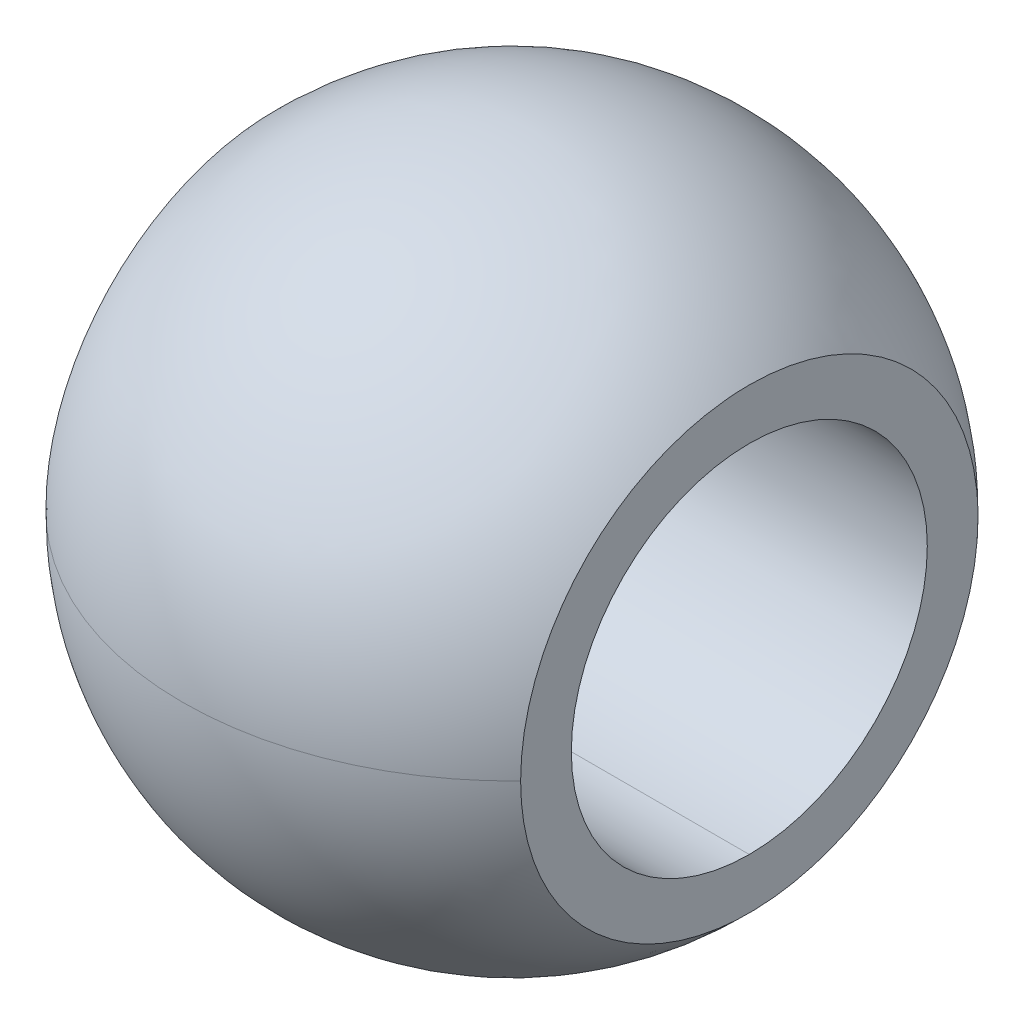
ISO-10303-21;
HEADER;
FILE_DESCRIPTION(('STEP AP214'),'2;1');
FILE_NAME('part.step','',(''),(''),'','','');
FILE_SCHEMA(('AUTOMOTIVE_DESIGN { 1 0 10303 214 1 1 1 1 }'));
ENDSEC;
DATA;
#1=APPLICATION_CONTEXT('core data for automotive mechanical design processes');
#2=APPLICATION_PROTOCOL_DEFINITION('international standard','automotive_design',2000,#1);
#3=PRODUCT_CONTEXT('',#1,'mechanical');
#4=PRODUCT('Part','Part','',(#3));
#5=PRODUCT_RELATED_PRODUCT_CATEGORY('part','',(#4));
#6=PRODUCT_DEFINITION_FORMATION('','',#4);
#7=PRODUCT_DEFINITION_CONTEXT('part definition',#1,'design');
#8=PRODUCT_DEFINITION('design','',#6,#7);
#9=PRODUCT_DEFINITION_SHAPE('','',#8);
#10=(LENGTH_UNIT() NAMED_UNIT(*) SI_UNIT(.MILLI.,.METRE.));
#11=(NAMED_UNIT(*) PLANE_ANGLE_UNIT() SI_UNIT($,.RADIAN.));
#12=(NAMED_UNIT(*) SI_UNIT($,.STERADIAN.) SOLID_ANGLE_UNIT());
#13=UNCERTAINTY_MEASURE_WITH_UNIT(LENGTH_MEASURE(1.E-05),#10,'distance_accuracy_value','');
#14=(GEOMETRIC_REPRESENTATION_CONTEXT(3) GLOBAL_UNCERTAINTY_ASSIGNED_CONTEXT((#13)) GLOBAL_UNIT_ASSIGNED_CONTEXT((#10,
#11,#12)) REPRESENTATION_CONTEXT('',''));
#15=CARTESIAN_POINT('',(0.,0.,0.));
#16=DIRECTION('',(0.,0.,1.));
#17=DIRECTION('',(1.,0.,0.));
#18=AXIS2_PLACEMENT_3D('',#15,#16,#17);
#19=CARTESIAN_POINT('',(0.,0.,0.));
#20=DIRECTION('',(-1.,0.,0.));
#21=DIRECTION('',(0.,0.,1.));
#22=AXIS2_PLACEMENT_3D('',#19,#20,#21);
#23=CYLINDRICAL_SURFACE('',#22,6.);
#24=CARTESIAN_POINT('',(-8.,0.,0.));
#25=DIRECTION('',(-1.,0.,0.));
#26=DIRECTION('',(0.,0.,1.));
#27=AXIS2_PLACEMENT_3D('',#24,#25,#26);
#28=CIRCLE('',#27,6.);
#29=CARTESIAN_POINT('',(-8.,6.,0.));
#30=VERTEX_POINT('',#29);
#31=CARTESIAN_POINT('',(-8.,-6.,0.));
#32=VERTEX_POINT('',#31);
#33=EDGE_CURVE('E68',#30,#32,#28,.T.);
#34=ORIENTED_EDGE('',*,*,#33,.T.);
#35=DIRECTION('',(-1.,0.,0.));
#36=VECTOR('',#35,1.);
#37=CARTESIAN_POINT('',(0.,-6.,0.));
#38=LINE('',#37,#36);
#39=CARTESIAN_POINT('',(8.,-6.,0.));
#40=VERTEX_POINT('',#39);
#41=EDGE_CURVE('E63',#32,#40,#38,.F.);
#42=ORIENTED_EDGE('',*,*,#41,.T.);
#43=CARTESIAN_POINT('',(8.,0.,0.));
#44=DIRECTION('',(-1.,0.,0.));
#45=DIRECTION('',(0.,0.,1.));
#46=AXIS2_PLACEMENT_3D('',#43,#44,#45);
#47=CIRCLE('',#46,6.);
#48=CARTESIAN_POINT('',(8.,6.,0.));
#49=VERTEX_POINT('',#48);
#50=EDGE_CURVE('E65',#40,#49,#47,.F.);
#51=ORIENTED_EDGE('',*,*,#50,.T.);
#52=DIRECTION('',(-1.,0.,0.));
#53=VECTOR('',#52,1.);
#54=CARTESIAN_POINT('',(0.,6.,0.));
#55=LINE('',#54,#53);
#56=EDGE_CURVE('E58',#49,#30,#55,.T.);
#57=ORIENTED_EDGE('',*,*,#56,.T.);
#58=EDGE_LOOP('',(#34,#42,#51,#57));
#59=FACE_BOUND('',#58,.T.);
#60=ADVANCED_FACE('F14',(#59),#23,.F.);
#61=CARTESIAN_POINT('',(0.,0.,0.));
#62=DIRECTION('',(-1.,0.,0.));
#63=DIRECTION('',(0.,0.,1.));
#64=AXIS2_PLACEMENT_3D('',#61,#62,#63);
#65=CYLINDRICAL_SURFACE('',#64,6.);
#66=CARTESIAN_POINT('',(8.,0.,0.));
#67=DIRECTION('',(-1.,0.,0.));
#68=DIRECTION('',(0.,0.,1.));
#69=AXIS2_PLACEMENT_3D('',#66,#67,#68);
#70=CIRCLE('',#69,6.);
#71=EDGE_CURVE('E17',#49,#40,#70,.F.);
#72=ORIENTED_EDGE('',*,*,#71,.T.);
#73=ORIENTED_EDGE('',*,*,#41,.F.);
#74=CARTESIAN_POINT('',(-8.,0.,0.));
#75=DIRECTION('',(-1.,0.,0.));
#76=DIRECTION('',(0.,0.,1.));
#77=AXIS2_PLACEMENT_3D('',#74,#75,#76);
#78=CIRCLE('',#77,6.);
#79=EDGE_CURVE('E154',#32,#30,#78,.T.);
#80=ORIENTED_EDGE('',*,*,#79,.T.);
#81=ORIENTED_EDGE('',*,*,#56,.F.);
#82=EDGE_LOOP('',(#72,#73,#80,#81));
#83=FACE_BOUND('',#82,.T.);
#84=ADVANCED_FACE('F71',(#83),#65,.F.);
#85=CARTESIAN_POINT('',(8.,22.22,-22.22));
#86=DIRECTION('',(-1.,0.,0.));
#87=DIRECTION('',(0.,0.,1.));
#88=AXIS2_PLACEMENT_3D('',#85,#86,#87);
#89=PLANE('',#88);
#90=CARTESIAN_POINT('',(8.,0.,7.70922175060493));
#91=CARTESIAN_POINT('',(8.,0.216830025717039,7.70924506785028));
#92=CARTESIAN_POINT('',(8.,0.433656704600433,7.70007486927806));
#93=CARTESIAN_POINT('',(8.,0.865758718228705,7.66351584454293));
#94=CARTESIAN_POINT('',(8.,1.08103412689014,7.63612789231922));
#95=CARTESIAN_POINT('',(8.,1.50834854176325,7.56332924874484));
#96=CARTESIAN_POINT('',(8.,1.72038987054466,7.51793219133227));
#97=CARTESIAN_POINT('',(8.,2.13989419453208,7.40944557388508));
#98=CARTESIAN_POINT('',(8.,2.34735724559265,7.34635622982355));
#99=CARTESIAN_POINT('',(8.,2.75629575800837,7.20290925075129));
#100=CARTESIAN_POINT('',(8.,2.95776938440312,7.12254638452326));
#101=CARTESIAN_POINT('',(8.,3.35330421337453,6.94510267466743));
#102=CARTESIAN_POINT('',(8.,3.5473626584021,6.84801568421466));
#103=CARTESIAN_POINT('',(8.,3.92653785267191,6.63787365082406));
#104=CARTESIAN_POINT('',(8.,4.11165789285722,6.52482454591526));
#105=CARTESIAN_POINT('',(8.,4.47172131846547,6.28353215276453));
#106=CARTESIAN_POINT('',(8.,4.64666448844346,6.15528854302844));
#107=CARTESIAN_POINT('',(8.,4.98512286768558,5.88452342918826));
#108=CARTESIAN_POINT('',(8.,5.1486383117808,5.74200221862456));
#109=CARTESIAN_POINT('',(8.,5.46308298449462,5.44369271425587));
#110=CARTESIAN_POINT('',(8.,5.61401220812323,5.28790441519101));
#111=CARTESIAN_POINT('',(8.,5.90224129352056,4.96413466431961));
#112=CARTESIAN_POINT('',(8.,6.03953834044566,4.79615070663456));
#113=CARTESIAN_POINT('',(8.,6.29948869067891,4.44921634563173));
#114=CARTESIAN_POINT('',(8.,6.42214229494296,4.270266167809));
#115=CARTESIAN_POINT('',(8.,6.65198160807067,3.90259649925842));
#116=CARTESIAN_POINT('',(8.,6.759161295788,3.71387324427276));
#117=CARTESIAN_POINT('',(8.,6.95719710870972,3.32813727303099));
#118=CARTESIAN_POINT('',(8.,7.04805915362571,3.13112759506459));
#119=CARTESIAN_POINT('',(8.,7.21283874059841,2.73020256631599));
#120=CARTESIAN_POINT('',(8.,7.28676111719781,2.5262892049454));
#121=CARTESIAN_POINT('',(8.,7.4171504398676,2.11304101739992));
#122=CARTESIAN_POINT('',(8.,7.47362158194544,1.9037075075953));
#123=CARTESIAN_POINT('',(8.,7.58364047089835,1.41469892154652));
#124=CARTESIAN_POINT('',(8.,7.63073189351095,1.13352921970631));
#125=CARTESIAN_POINT('',(8.,7.67782031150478,0.709516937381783));
#126=CARTESIAN_POINT('',(8.,7.68959165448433,0.567875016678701));
#127=CARTESIAN_POINT('',(8.,7.70529140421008,0.284167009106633));
#128=CARTESIAN_POINT('',(8.,7.70922035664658,0.142100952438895));
#129=CARTESIAN_POINT('',(8.,7.70922175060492,0.));
#130=B_SPLINE_CURVE_WITH_KNOTS('',3,(#90,#91,#92,#93,#94,#95,#96,#97,#98,#99,#100,#101,#102,
#103,#104,#105,#106,#107,#108,#109,#110,#111,#112,#113,#114,#115,#116,#117,#118,#119,#120,#121,
#122,#123,#124,#125,#126,#127,#128,#129),.UNSPECIFIED.,.F.,.F.,(4,2,2,2,2,2,2,2,2,2,2,2,2,2,2,2,
2,2,2,4),(0.,0.650291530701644,1.3005518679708,1.95032085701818,2.60008191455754,
3.25004002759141,3.90023753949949,4.55019380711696,5.20016382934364,5.85012049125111,
6.50007741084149,7.15016825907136,7.80024574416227,8.45057550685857,9.10066886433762,
9.75057645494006,10.400327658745,11.2536016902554,11.6798102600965,12.1059891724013),.UNSPECIFIED.);
#131=CARTESIAN_POINT('',(8.,0.,7.70922175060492));
#132=VERTEX_POINT('',#131);
#133=CARTESIAN_POINT('',(8.,7.70922175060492,0.));
#134=VERTEX_POINT('',#133);
#135=EDGE_CURVE('E74',#132,#134,#130,.T.);
#136=ORIENTED_EDGE('',*,*,#135,.F.);
#137=CARTESIAN_POINT('',(8.,-3.42087469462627E-12,-7.70922175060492));
#138=CARTESIAN_POINT('',(8.,-0.216824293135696,-7.70924506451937));
#139=CARTESIAN_POINT('',(8.,-0.433645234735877,-7.70007535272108));
#140=CARTESIAN_POINT('',(8.,-0.865735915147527,-7.66351825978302));
#141=CARTESIAN_POINT('',(8.,-1.08100572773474,-7.6361317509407));
#142=CARTESIAN_POINT('',(8.,-1.5083204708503,-7.56333501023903));
#143=CARTESIAN_POINT('',(8.,-1.72036756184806,-7.51793746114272));
#144=CARTESIAN_POINT('',(8.,-2.13988321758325,-7.40944891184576));
#145=CARTESIAN_POINT('',(8.,-2.34735183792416,-7.34635812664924));
#146=CARTESIAN_POINT('',(8.,-2.75629772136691,-7.20290856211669));
#147=CARTESIAN_POINT('',(8.,-2.95777325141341,-7.1225448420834));
#148=CARTESIAN_POINT('',(8.,-3.35331195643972,-6.94509900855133));
#149=CARTESIAN_POINT('',(8.,-3.54737236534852,-6.84801072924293));
#150=CARTESIAN_POINT('',(8.,-3.92654784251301,-6.63786768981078));
#151=CARTESIAN_POINT('',(8.,-4.11166636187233,-6.52481915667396));
#152=CARTESIAN_POINT('',(8.,-4.4717258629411,-6.28352882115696));
#153=CARTESIAN_POINT('',(8.,-4.64666668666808,-6.15528678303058));
#154=CARTESIAN_POINT('',(8.,-4.98512457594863,-5.88452206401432));
#155=CARTESIAN_POINT('',(8.,-5.14864161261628,-5.74199934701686));
#156=CARTESIAN_POINT('',(8.,-5.46309286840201,-5.4436830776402));
#157=CARTESIAN_POINT('',(8.,-5.61402679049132,-5.28788921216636));
#158=CARTESIAN_POINT('',(8.,-5.90222990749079,-4.96414627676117));
#159=CARTESIAN_POINT('',(8.,-6.03949954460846,-4.79619760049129));
#160=CARTESIAN_POINT('',(8.,-6.2994489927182,-4.44927421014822));
#161=CARTESIAN_POINT('',(8.,-6.42212373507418,-4.2702956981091));
#162=CARTESIAN_POINT('',(8.,-6.65192940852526,-3.90268016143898));
#163=CARTESIAN_POINT('',(8.,-6.75906387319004,-3.71404534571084));
#164=CARTESIAN_POINT('',(8.,-6.95706266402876,-3.32841678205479));
#165=CARTESIAN_POINT('',(8.,-7.04792665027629,-3.13142285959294));
#166=CARTESIAN_POINT('',(8.,-7.21272866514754,-2.73049747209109));
#167=CARTESIAN_POINT('',(8.,-7.28666813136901,-2.52656659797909));
#168=CARTESIAN_POINT('',(8.,-7.41710674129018,-2.11319681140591));
#169=CARTESIAN_POINT('',(8.,-7.47360552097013,-1.90375778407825));
#170=CARTESIAN_POINT('',(8.,-7.56875948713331,-1.48086257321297));
#171=CARTESIAN_POINT('',(8.,-7.60741449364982,-1.26740634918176));
#172=CARTESIAN_POINT('',(8.,-7.66660526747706,-0.837996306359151));
#173=CARTESIAN_POINT('',(8.,-7.68714103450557,-0.622042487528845));
#174=CARTESIAN_POINT('',(8.,-7.70994771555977,-0.189165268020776));
#175=CARTESIAN_POINT('',(8.,-7.71221801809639,0.0277581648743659));
#176=CARTESIAN_POINT('',(8.,-7.6984761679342,0.461020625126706));
#177=CARTESIAN_POINT('',(8.,-7.68246439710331,0.677359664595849));
#178=CARTESIAN_POINT('',(8.,-7.63227257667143,1.10792222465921));
#179=CARTESIAN_POINT('',(8.,-7.59809232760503,1.32214572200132));
#180=CARTESIAN_POINT('',(8.,-7.51180734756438,1.74694727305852));
#181=CARTESIAN_POINT('',(8.,-7.4597029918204,1.95752540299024));
#182=CARTESIAN_POINT('',(8.,-7.3379290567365,2.37358135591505));
#183=CARTESIAN_POINT('',(8.,-7.26825631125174,2.57905825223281));
#184=CARTESIAN_POINT('',(8.,-7.11187287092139,2.98334093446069));
#185=CARTESIAN_POINT('',(8.,-7.02516808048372,3.18214900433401));
#186=CARTESIAN_POINT('',(8.,-6.83530146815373,3.57179679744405));
#187=CARTESIAN_POINT('',(8.,-6.73213618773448,3.76263483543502));
#188=CARTESIAN_POINT('',(8.,-6.51009762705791,4.13493717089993));
#189=CARTESIAN_POINT('',(8.,-6.39122469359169,4.3164016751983));
#190=CARTESIAN_POINT('',(8.,-6.13861804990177,4.66866598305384));
#191=CARTESIAN_POINT('',(8.,-6.00488479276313,4.83946611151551));
#192=CARTESIAN_POINT('',(8.,-5.72350750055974,5.1691908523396));
#193=CARTESIAN_POINT('',(8.,-5.5758636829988,5.32811565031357));
#194=CARTESIAN_POINT('',(8.,-5.26770593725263,5.63296996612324));
#195=CARTESIAN_POINT('',(8.,-5.10719141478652,5.77889888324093));
#196=CARTESIAN_POINT('',(8.,-4.77449703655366,6.05666757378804));
#197=CARTESIAN_POINT('',(8.,-4.60232123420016,6.18851220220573));
#198=CARTESIAN_POINT('',(8.,-4.24738804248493,6.43729651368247));
#199=CARTESIAN_POINT('',(8.,-4.06462533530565,6.55422861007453));
#200=CARTESIAN_POINT('',(8.,-3.68990313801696,6.77227461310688));
#201=CARTESIAN_POINT('',(8.,-3.49794392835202,6.87338900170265));
#202=CARTESIAN_POINT('',(8.,-3.10606463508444,7.05914382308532));
#203=CARTESIAN_POINT('',(8.,-2.90613957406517,7.14377375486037));
#204=CARTESIAN_POINT('',(8.,-2.49986914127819,7.29587547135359));
#205=CARTESIAN_POINT('',(8.,-2.29352390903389,7.36334762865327));
#206=CARTESIAN_POINT('',(8.,-1.87615267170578,7.48058033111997));
#207=CARTESIAN_POINT('',(8.,-1.66513298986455,7.53036341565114));
#208=CARTESIAN_POINT('',(8.,-1.23973489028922,7.61196608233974));
#209=CARTESIAN_POINT('',(8.,-1.0253581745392,7.64379448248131));
#210=CARTESIAN_POINT('',(8.,-0.675429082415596,7.68077042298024));
#211=CARTESIAN_POINT('',(8.,-0.540436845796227,7.69144647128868));
#212=CARTESIAN_POINT('',(8.,-0.270301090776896,7.70566702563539));
#213=CARTESIAN_POINT('',(8.,-0.135158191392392,7.70922329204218));
#214=CARTESIAN_POINT('',(8.,0.,7.70922175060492));
#215=B_SPLINE_CURVE_WITH_KNOTS('',3,(#137,#138,#139,#140,#141,#142,#143,#144,#145,#146,#147,
#148,#149,#150,#151,#152,#153,#154,#155,#156,#157,#158,#159,#160,#161,#162,#163,#164,#165,#166,
#167,#168,#169,#170,#171,#172,#173,#174,#175,#176,#177,#178,#179,#180,#181,#182,#183,#184,#185,
#186,#187,#188,#189,#190,#191,#192,#193,#194,#195,#196,#197,#198,#199,#200,#201,#202,#203,#204,
#205,#206,#207,#208,#209,#210,#211,#212,#213,#214),.UNSPECIFIED.,.F.,.F.,(4,2,2,2,2,2,2,2,2,2,2,
2,2,2,2,2,2,2,2,2,2,2,2,2,2,2,2,2,2,2,2,2,2,2,2,2,2,2,4),(0.,0.650274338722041,1.30051754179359,
1.95030367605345,2.60008191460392,3.25004626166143,3.90025074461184,4.55020224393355,
5.20016382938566,5.85012705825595,6.50010562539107,7.15006315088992,7.80024574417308,
8.45028026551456,9.10032836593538,9.75032122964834,10.4003276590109,11.0503406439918,
11.700353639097,12.3503883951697,13.00040957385,13.6504378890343,14.3004525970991,
14.9505845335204,15.6004914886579,16.2505351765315,16.9005645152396,17.5505740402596,
18.200573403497,18.8506027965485,19.5004073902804,20.1505412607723,20.8006553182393,
21.4511821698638,22.1016948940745,22.7513757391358,23.400737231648,23.8068059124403,
24.2122032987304),.UNSPECIFIED.);
#216=CARTESIAN_POINT('',(8.,-3.42000733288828E-12,-7.70922175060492));
#217=VERTEX_POINT('',#216);
#218=EDGE_CURVE('E151',#217,#132,#215,.T.);
#219=ORIENTED_EDGE('',*,*,#218,.F.);
#220=CARTESIAN_POINT('',(8.,7.70922175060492,0.));
#221=CARTESIAN_POINT('',(8.,7.70924506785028,-0.216830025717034));
#222=CARTESIAN_POINT('',(8.,7.70007486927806,-0.433656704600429));
#223=CARTESIAN_POINT('',(8.,7.66351584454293,-0.865758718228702));
#224=CARTESIAN_POINT('',(8.,7.63612789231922,-1.08103412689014));
#225=CARTESIAN_POINT('',(8.,7.56332924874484,-1.50834854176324));
#226=CARTESIAN_POINT('',(8.,7.51793219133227,-1.72038987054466));
#227=CARTESIAN_POINT('',(8.,7.40944557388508,-2.13989419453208));
#228=CARTESIAN_POINT('',(8.,7.34635622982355,-2.34735724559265));
#229=CARTESIAN_POINT('',(8.,7.20290925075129,-2.75629575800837));
#230=CARTESIAN_POINT('',(8.,7.12254638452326,-2.95776938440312));
#231=CARTESIAN_POINT('',(8.,6.94510267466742,-3.35330421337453));
#232=CARTESIAN_POINT('',(8.,6.84801568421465,-3.5473626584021));
#233=CARTESIAN_POINT('',(8.,6.63787365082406,-3.92653785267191));
#234=CARTESIAN_POINT('',(8.,6.52482454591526,-4.11165789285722));
#235=CARTESIAN_POINT('',(8.,6.28353215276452,-4.47172131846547));
#236=CARTESIAN_POINT('',(8.,6.15528854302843,-4.64666448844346));
#237=CARTESIAN_POINT('',(8.,5.88452342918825,-4.98512286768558));
#238=CARTESIAN_POINT('',(8.,5.74200221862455,-5.1486383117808));
#239=CARTESIAN_POINT('',(8.,5.44369271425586,-5.46308298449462));
#240=CARTESIAN_POINT('',(8.,5.28790441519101,-5.61401220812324));
#241=CARTESIAN_POINT('',(8.,4.9641346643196,-5.90224129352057));
#242=CARTESIAN_POINT('',(8.,4.79615070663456,-6.03953834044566));
#243=CARTESIAN_POINT('',(8.,4.44921634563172,-6.29948869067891));
#244=CARTESIAN_POINT('',(8.,4.27026616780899,-6.42214229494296));
#245=CARTESIAN_POINT('',(8.,3.90259649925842,-6.65198160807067));
#246=CARTESIAN_POINT('',(8.,3.71387324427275,-6.759161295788));
#247=CARTESIAN_POINT('',(8.,3.32813727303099,-6.95719710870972));
#248=CARTESIAN_POINT('',(8.,3.13112759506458,-7.0480591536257));
#249=CARTESIAN_POINT('',(8.,2.73020256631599,-7.21283874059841));
#250=CARTESIAN_POINT('',(8.,2.5262892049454,-7.28676111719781));
#251=CARTESIAN_POINT('',(8.,2.11304101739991,-7.4171504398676));
#252=CARTESIAN_POINT('',(8.,1.90370750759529,-7.47362158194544));
#253=CARTESIAN_POINT('',(8.,1.41469892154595,-7.58364047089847));
#254=CARTESIAN_POINT('',(8.,1.13352921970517,-7.63073189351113));
#255=CARTESIAN_POINT('',(8.,0.709516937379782,-7.67782031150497));
#256=CARTESIAN_POINT('',(8.,0.567875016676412,-7.6895916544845));
#257=CARTESIAN_POINT('',(8.,0.284167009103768,-7.7052914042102));
#258=CARTESIAN_POINT('',(8.,0.142100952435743,-7.70922035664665));
#259=CARTESIAN_POINT('',(8.,-3.43648720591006E-12,-7.70922175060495));
#260=B_SPLINE_CURVE_WITH_KNOTS('',3,(#220,#221,#222,#223,#224,#225,#226,#227,#228,#229,#230,
#231,#232,#233,#234,#235,#236,#237,#238,#239,#240,#241,#242,#243,#244,#245,#246,#247,#248,#249,
#250,#251,#252,#253,#254,#255,#256,#257,#258,#259),.UNSPECIFIED.,.F.,.F.,(4,2,2,2,2,2,2,2,2,2,2,
2,2,2,2,2,2,2,2,4),(0.,0.650291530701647,1.30055186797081,1.95032085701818,2.60008191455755,
3.25004002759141,3.90023753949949,4.55019380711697,5.20016382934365,5.85012049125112,
6.5000774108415,7.15016825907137,7.80024574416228,8.45057550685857,9.10066886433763,
9.75057645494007,10.400327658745,11.2536016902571,11.6798102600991,12.1059891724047),.UNSPECIFIED.);
#261=EDGE_CURVE('E76',#134,#217,#260,.T.);
#262=ORIENTED_EDGE('',*,*,#261,.F.);
#263=EDGE_LOOP('',(#136,#219,#262));
#264=FACE_BOUND('',#263,.T.);
#265=ORIENTED_EDGE('',*,*,#71,.F.);
#266=ORIENTED_EDGE('',*,*,#50,.F.);
#267=EDGE_LOOP('',(#265,#266));
#268=FACE_BOUND('',#267,.T.);
#269=ADVANCED_FACE('F73',(#264,#268),#89,.F.);
#270=CARTESIAN_POINT('',(0.,0.,0.));
#271=DIRECTION('',(0.,0.,-1.));
#272=DIRECTION('',(0.,1.,0.));
#273=AXIS2_PLACEMENT_3D('',#270,#271,#272);
#274=SPHERICAL_SURFACE('',#273,11.11);
#275=ORIENTED_EDGE('',*,*,#135,.T.);
#276=ORIENTED_EDGE('',*,*,#261,.T.);
#277=CARTESIAN_POINT('',(0.,0.,-11.11));
#278=CARTESIAN_POINT('',(0.186070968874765,-4.76982458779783E-13,-11.1100042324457));
#279=CARTESIAN_POINT('',(0.372141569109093,-9.53963972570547E-13,-11.1053256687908));
#280=CARTESIAN_POINT('',(0.743813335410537,-1.90672363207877E-12,-11.0866333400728));
#281=CARTESIAN_POINT('',(0.929414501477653,-2.38250177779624E-12,-11.0726195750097));
#282=CARTESIAN_POINT('',(1.29967870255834,-3.3316532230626E-12,-11.0352872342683));
#283=CARTESIAN_POINT('',(1.4843417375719,-3.8050265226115E-12,-11.0119686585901));
#284=CARTESIAN_POINT('',(1.85226366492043,-4.74817368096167E-12,-10.9560868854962));
#285=CARTESIAN_POINT('',(2.03552255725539,-5.21794753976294E-12,-10.9235236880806));
#286=CARTESIAN_POINT('',(2.40017364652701,-6.15271008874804E-12,-10.8492345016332));
#287=CARTESIAN_POINT('',(2.58156584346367,-6.61769877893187E-12,-10.8075085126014));
#288=CARTESIAN_POINT('',(2.9420257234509,-7.54171739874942E-12,-10.7149991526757));
#289=CARTESIAN_POINT('',(3.12109340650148,-8.00074732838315E-12,-10.6642157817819));
#290=CARTESIAN_POINT('',(3.47645230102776,-8.91168985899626E-12,-10.5537198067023));
#291=CARTESIAN_POINT('',(3.65274351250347,-9.36360245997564E-12,-10.4940072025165));
#292=CARTESIAN_POINT('',(4.00210451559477,-1.02591697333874E-11,-10.3658034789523));
#293=CARTESIAN_POINT('',(4.17517430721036,-1.07028244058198E-11,-10.297312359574));
#294=CARTESIAN_POINT('',(4.5176556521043,-1.15807560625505E-11,-10.1517244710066));
#295=CARTESIAN_POINT('',(4.68706720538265,-1.20150330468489E-11,-10.0746277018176));
#296=CARTESIAN_POINT('',(5.02180449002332,-1.28731132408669E-11,-9.91202310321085));
#297=CARTESIAN_POINT('',(5.18713022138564,-1.32969164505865E-11,-9.82651527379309));
#298=CARTESIAN_POINT('',(5.51327858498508,-1.41329794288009E-11,-9.64730436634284));
#299=CARTESIAN_POINT('',(5.67410121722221,-1.45452391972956E-11,-9.55360128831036));
#300=CARTESIAN_POINT('',(5.99083749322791,-1.53571748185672E-11,-9.35823640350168));
#301=CARTESIAN_POINT('',(6.14675113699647,-1.57568506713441E-11,-9.25657459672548));
#302=CARTESIAN_POINT('',(6.45327585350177,-1.65426095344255E-11,-9.04554877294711));
#303=CARTESIAN_POINT('',(6.60388692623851,-1.69286925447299E-11,-8.93618475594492));
#304=CARTESIAN_POINT('',(6.89942661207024,-1.76862918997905E-11,-8.71003080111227));
#305=CARTESIAN_POINT('',(7.04435522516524,-1.80578082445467E-11,-8.5932408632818));
#306=CARTESIAN_POINT('',(7.32816328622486,-1.87853342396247E-11,-8.35252886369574));
#307=CARTESIAN_POINT('',(7.46704273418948,-1.91413438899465E-11,-8.22860680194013));
#308=CARTESIAN_POINT('',(7.73840535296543,-1.98369666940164E-11,-7.97394696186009));
#309=CARTESIAN_POINT('',(7.87088852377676,-2.01765798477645E-11,-7.84320918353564));
#310=CARTESIAN_POINT('',(8.,-2.05075498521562E-11,-7.70922175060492));
#311=B_SPLINE_CURVE_WITH_KNOTS('',3,(#277,#278,#279,#280,#281,#282,#283,#284,#285,#286,#287,
#288,#289,#290,#291,#292,#293,#294,#295,#296,#297,#298,#299,#300,#301,#302,#303,#304,#305,#306,
#307,#308,#309,#310),.UNSPECIFIED.,.F.,.F.,(4,2,2,2,2,2,2,2,2,2,2,2,2,2,2,2,4),(0.,
0.558153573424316,1.11630714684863,1.67446072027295,2.23261429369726,2.79076786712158,
3.3489214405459,3.90707501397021,4.46522858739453,5.02338216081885,5.58153573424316,
6.13968930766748,6.69784288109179,7.25599645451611,7.81415002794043,8.37230360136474,
8.93045717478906),.UNSPECIFIED.);
#312=CARTESIAN_POINT('',(0.,0.,-11.11));
#313=VERTEX_POINT('',#312);
#314=EDGE_CURVE('E145',#313,#217,#311,.T.);
#315=ORIENTED_EDGE('',*,*,#314,.F.);
#316=CARTESIAN_POINT('',(0.,0.,0.));
#317=DIRECTION('',(-2.56435478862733E-12,1.,0.));
#318=DIRECTION('',(0.,0.,-1.));
#319=AXIS2_PLACEMENT_3D('',#316,#317,#318);
#320=CIRCLE('',#319,11.11);
#321=CARTESIAN_POINT('',(-8.,-1.19669891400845E-11,-7.70922175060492));
#322=VERTEX_POINT('',#321);
#323=EDGE_CURVE('E147',#322,#313,#320,.F.);
#324=ORIENTED_EDGE('',*,*,#323,.F.);
#325=CARTESIAN_POINT('',(-8.,-3.41913997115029E-12,-7.70922175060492));
#326=CARTESIAN_POINT('',(-8.,0.216824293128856,-7.70924506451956));
#327=CARTESIAN_POINT('',(-8.,0.433645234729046,-7.70007535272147));
#328=CARTESIAN_POINT('',(-8.,0.865735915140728,-7.66351825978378));
#329=CARTESIAN_POINT('',(-8.,1.08100572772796,-7.63613175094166));
#330=CARTESIAN_POINT('',(-8.,1.5083204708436,-7.56333501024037));
#331=CARTESIAN_POINT('',(-8.,1.72036756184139,-7.51793746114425));
#332=CARTESIAN_POINT('',(-8.,2.13988321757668,-7.40944891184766));
#333=CARTESIAN_POINT('',(-8.,2.34735183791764,-7.34635812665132));
#334=CARTESIAN_POINT('',(-8.,2.75629772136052,-7.20290856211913));
#335=CARTESIAN_POINT('',(-8.,2.95777325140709,-7.12254484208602));
#336=CARTESIAN_POINT('',(-8.,3.35331195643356,-6.94509900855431));
#337=CARTESIAN_POINT('',(-8.,3.54737236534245,-6.84801072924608));
#338=CARTESIAN_POINT('',(-8.,3.92654784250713,-6.63786768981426));
#339=CARTESIAN_POINT('',(-8.,4.11166636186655,-6.5248191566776));
#340=CARTESIAN_POINT('',(-8.,4.47172586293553,-6.28352882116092));
#341=CARTESIAN_POINT('',(-8.,4.64666668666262,-6.1552867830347));
#342=CARTESIAN_POINT('',(-8.,4.98512457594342,-5.88452206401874));
#343=CARTESIAN_POINT('',(-8.,5.14864161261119,-5.74199934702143));
#344=CARTESIAN_POINT('',(-8.,5.46309286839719,-5.44368307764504));
#345=CARTESIAN_POINT('',(-8.,5.61402679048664,-5.28788921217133));
#346=CARTESIAN_POINT('',(-8.,5.90222990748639,-4.9641462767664));
#347=CARTESIAN_POINT('',(-8.,6.03949954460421,-4.79619760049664));
#348=CARTESIAN_POINT('',(-8.,6.29944899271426,-4.44927421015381));
#349=CARTESIAN_POINT('',(-8.,6.4221237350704,-4.2702956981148));
#350=CARTESIAN_POINT('',(-8.,6.6519294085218,-3.90268016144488));
#351=CARTESIAN_POINT('',(-8.,6.75906387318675,-3.71404534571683));
#352=CARTESIAN_POINT('',(-8.,6.95706266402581,-3.32841678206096));
#353=CARTESIAN_POINT('',(-8.,7.04792665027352,-3.13142285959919));
#354=CARTESIAN_POINT('',(-8.,7.21272866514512,-2.73049747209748));
#355=CARTESIAN_POINT('',(-8.,7.28666813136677,-2.52656659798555));
#356=CARTESIAN_POINT('',(-8.,7.41710674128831,-2.11319681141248));
#357=CARTESIAN_POINT('',(-8.,7.47360552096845,-1.90375778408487));
#358=CARTESIAN_POINT('',(-8.,7.568759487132,-1.48086257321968));
#359=CARTESIAN_POINT('',(-8.,7.60741449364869,-1.2674063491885));
#360=CARTESIAN_POINT('',(-8.,7.66660526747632,-0.837996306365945));
#361=CARTESIAN_POINT('',(-8.,7.68714103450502,-0.622042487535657));
#362=CARTESIAN_POINT('',(-8.,7.7099477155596,-0.189165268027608));
#363=CARTESIAN_POINT('',(-8.,7.71221801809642,0.0277581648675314));
#364=CARTESIAN_POINT('',(-8.,7.69847616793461,0.461020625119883));
#365=CARTESIAN_POINT('',(-8.,7.68246439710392,0.677359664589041));
#366=CARTESIAN_POINT('',(-8.,7.63227257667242,1.10792222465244));
#367=CARTESIAN_POINT('',(-8.,7.5980923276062,1.32214572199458));
#368=CARTESIAN_POINT('',(-8.,7.51180734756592,1.74694727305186));
#369=CARTESIAN_POINT('',(-8.,7.45970299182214,1.95752540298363));
#370=CARTESIAN_POINT('',(-8.,7.33792905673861,2.37358135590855));
#371=CARTESIAN_POINT('',(-8.,7.26825631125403,2.57905825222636));
#372=CARTESIAN_POINT('',(-8.,7.11187287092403,2.98334093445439));
#373=CARTESIAN_POINT('',(-8.,7.02516808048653,3.18214900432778));
#374=CARTESIAN_POINT('',(-8.,6.83530146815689,3.57179679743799));
#375=CARTESIAN_POINT('',(-8.,6.73213618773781,3.76263483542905));
#376=CARTESIAN_POINT('',(-8.,6.51009762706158,4.13493717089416));
#377=CARTESIAN_POINT('',(-8.,6.39122469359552,4.31640167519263));
#378=CARTESIAN_POINT('',(-8.,6.13861804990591,4.6686659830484));
#379=CARTESIAN_POINT('',(-8.,6.00488479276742,4.83946611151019));
#380=CARTESIAN_POINT('',(-8.,5.72350750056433,5.16919085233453));
#381=CARTESIAN_POINT('',(-8.,5.57586368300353,5.32811565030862));
#382=CARTESIAN_POINT('',(-8.,5.26770593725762,5.63296996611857));
#383=CARTESIAN_POINT('',(-8.,5.10719141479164,5.7788988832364));
#384=CARTESIAN_POINT('',(-8.,4.77449703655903,6.0566675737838));
#385=CARTESIAN_POINT('',(-8.,4.60232123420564,6.18851220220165));
#386=CARTESIAN_POINT('',(-8.,4.24738804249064,6.4372965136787));
#387=CARTESIAN_POINT('',(-8.,4.06462533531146,6.55422861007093));
#388=CARTESIAN_POINT('',(-8.,3.68990313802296,6.77227461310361));
#389=CARTESIAN_POINT('',(-8.,3.4979439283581,6.87338900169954));
#390=CARTESIAN_POINT('',(-8.,3.10606463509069,7.05914382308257));
#391=CARTESIAN_POINT('',(-8.,2.9061395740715,7.1437737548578));
#392=CARTESIAN_POINT('',(-8.,2.49986914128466,7.29587547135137));
#393=CARTESIAN_POINT('',(-8.,2.29352390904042,7.36334762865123));
#394=CARTESIAN_POINT('',(-8.,1.87615267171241,7.4805803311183));
#395=CARTESIAN_POINT('',(-8.,1.66513298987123,7.53036341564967));
#396=CARTESIAN_POINT('',(-8.,1.23973489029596,7.61196608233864));
#397=CARTESIAN_POINT('',(-8.,1.02535817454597,7.6437944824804));
#398=CARTESIAN_POINT('',(-8.,0.675429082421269,7.68077042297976));
#399=CARTESIAN_POINT('',(-8.,0.540436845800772,7.69144647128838));
#400=CARTESIAN_POINT('',(-8.,0.270301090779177,7.70566702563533));
#401=CARTESIAN_POINT('',(-8.,0.135158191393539,7.70922329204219));
#402=CARTESIAN_POINT('',(-8.,0.,7.70922175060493));
#403=B_SPLINE_CURVE_WITH_KNOTS('',3,(#325,#326,#327,#328,#329,#330,#331,#332,#333,#334,#335,
#336,#337,#338,#339,#340,#341,#342,#343,#344,#345,#346,#347,#348,#349,#350,#351,#352,#353,#354,
#355,#356,#357,#358,#359,#360,#361,#362,#363,#364,#365,#366,#367,#368,#369,#370,#371,#372,#373,
#374,#375,#376,#377,#378,#379,#380,#381,#382,#383,#384,#385,#386,#387,#388,#389,#390,#391,#392,
#393,#394,#395,#396,#397,#398,#399,#400,#401,#402),.UNSPECIFIED.,.F.,.F.,(4,2,2,2,2,2,2,2,2,2,2,
2,2,2,2,2,2,2,2,2,2,2,2,2,2,2,2,2,2,2,2,2,2,2,2,2,2,2,4),(0.,0.650274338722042,1.30051754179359,
1.95030367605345,2.60008191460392,3.25004626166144,3.90025074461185,4.55020224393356,
5.20016382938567,5.85012705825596,6.50010562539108,7.15006315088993,7.80024574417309,
8.45028026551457,9.10032836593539,9.75032122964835,10.4003276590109,11.0503406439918,
11.700353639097,12.3503883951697,13.00040957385,13.6504378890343,14.3004525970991,
14.9505845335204,15.6004914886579,16.2505351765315,16.9005645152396,17.5505740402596,
18.200573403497,18.8506027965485,19.5004073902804,20.1505412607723,20.8006553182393,
21.4511821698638,22.1016948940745,22.7513757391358,23.400737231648,23.8068059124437,
24.2122032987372),.UNSPECIFIED.);
#404=CARTESIAN_POINT('',(-8.,0.,7.70922175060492));
#405=VERTEX_POINT('',#404);
#406=EDGE_CURVE('E152',#322,#405,#403,.T.);
#407=ORIENTED_EDGE('',*,*,#406,.T.);
#408=CARTESIAN_POINT('',(0.,0.,11.11));
#409=CARTESIAN_POINT('',(-0.186070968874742,0.,11.1100042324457));
#410=CARTESIAN_POINT('',(-0.372141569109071,0.,11.1053256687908));
#411=CARTESIAN_POINT('',(-0.743813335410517,0.,11.0866333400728));
#412=CARTESIAN_POINT('',(-0.929414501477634,0.,11.0726195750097));
#413=CARTESIAN_POINT('',(-1.29967870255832,0.,11.0352872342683));
#414=CARTESIAN_POINT('',(-1.48434173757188,0.,11.0119686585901));
#415=CARTESIAN_POINT('',(-1.85226366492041,0.,10.9560868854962));
#416=CARTESIAN_POINT('',(-2.03552255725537,0.,10.9235236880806));
#417=CARTESIAN_POINT('',(-2.400173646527,0.,10.8492345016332));
#418=CARTESIAN_POINT('',(-2.58156584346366,0.,10.8075085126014));
#419=CARTESIAN_POINT('',(-2.94202572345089,0.,10.7149991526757));
#420=CARTESIAN_POINT('',(-3.12109340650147,0.,10.6642157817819));
#421=CARTESIAN_POINT('',(-3.47645230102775,0.,10.5537198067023));
#422=CARTESIAN_POINT('',(-3.65274351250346,0.,10.4940072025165));
#423=CARTESIAN_POINT('',(-4.00210451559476,0.,10.3658034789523));
#424=CARTESIAN_POINT('',(-4.17517430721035,0.,10.297312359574));
#425=CARTESIAN_POINT('',(-4.5176556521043,0.,10.1517244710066));
#426=CARTESIAN_POINT('',(-4.68706720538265,0.,10.0746277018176));
#427=CARTESIAN_POINT('',(-5.02180449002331,0.,9.91202310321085));
#428=CARTESIAN_POINT('',(-5.18713022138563,0.,9.82651527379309));
#429=CARTESIAN_POINT('',(-5.51327858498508,0.,9.64730436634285));
#430=CARTESIAN_POINT('',(-5.67410121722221,0.,9.55360128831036));
#431=CARTESIAN_POINT('',(-5.9908374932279,0.,9.35823640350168));
#432=CARTESIAN_POINT('',(-6.14675113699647,0.,9.25657459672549));
#433=CARTESIAN_POINT('',(-6.45327585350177,0.,9.04554877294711));
#434=CARTESIAN_POINT('',(-6.60388692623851,0.,8.93618475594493));
#435=CARTESIAN_POINT('',(-6.89942661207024,0.,8.71003080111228));
#436=CARTESIAN_POINT('',(-7.04435522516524,0.,8.59324086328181));
#437=CARTESIAN_POINT('',(-7.32816328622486,0.,8.35252886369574));
#438=CARTESIAN_POINT('',(-7.46704273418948,0.,8.22860680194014));
#439=CARTESIAN_POINT('',(-7.73840535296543,0.,7.97394696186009));
#440=CARTESIAN_POINT('',(-7.87088852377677,0.,7.84320918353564));
#441=CARTESIAN_POINT('',(-8.,0.,7.70922175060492));
#442=B_SPLINE_CURVE_WITH_KNOTS('',3,(#408,#409,#410,#411,#412,#413,#414,#415,#416,#417,#418,
#419,#420,#421,#422,#423,#424,#425,#426,#427,#428,#429,#430,#431,#432,#433,#434,#435,#436,#437,
#438,#439,#440,#441),.UNSPECIFIED.,.F.,.F.,(4,2,2,2,2,2,2,2,2,2,2,2,2,2,2,2,4),(0.,
0.558153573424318,1.11630714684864,1.67446072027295,2.23261429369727,2.79076786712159,
3.34892144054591,3.90707501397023,4.46522858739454,5.02338216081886,5.58153573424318,
6.1396893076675,6.69784288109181,7.25599645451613,7.81415002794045,8.37230360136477,
8.93045717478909),.UNSPECIFIED.);
#443=CARTESIAN_POINT('',(0.,0.,11.11));
#444=VERTEX_POINT('',#443);
#445=EDGE_CURVE('E113',#444,#405,#442,.T.);
#446=ORIENTED_EDGE('',*,*,#445,.F.);
#447=CARTESIAN_POINT('',(0.,0.,0.));
#448=DIRECTION('',(0.,-1.,0.));
#449=DIRECTION('',(0.,0.,-1.));
#450=AXIS2_PLACEMENT_3D('',#447,#448,#449);
#451=CIRCLE('',#450,11.11);
#452=EDGE_CURVE('E179',#132,#444,#451,.T.);
#453=ORIENTED_EDGE('',*,*,#452,.F.);
#454=EDGE_LOOP('',(#275,#276,#315,#324,#407,#446,#453));
#455=FACE_BOUND('',#454,.T.);
#456=ADVANCED_FACE('F92',(#455),#274,.T.);
#457=CARTESIAN_POINT('',(-8.,22.22,22.22));
#458=DIRECTION('',(1.,0.,0.));
#459=DIRECTION('',(0.,0.,-1.));
#460=AXIS2_PLACEMENT_3D('',#457,#458,#459);
#461=PLANE('',#460);
#462=CARTESIAN_POINT('',(-8.,0.,7.70922175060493));
#463=CARTESIAN_POINT('',(-8.,-0.21683002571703,7.70924506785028));
#464=CARTESIAN_POINT('',(-8.,-0.433656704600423,7.70007486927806));
#465=CARTESIAN_POINT('',(-8.,-0.865758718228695,7.66351584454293));
#466=CARTESIAN_POINT('',(-8.,-1.08103412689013,7.63612789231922));
#467=CARTESIAN_POINT('',(-8.,-1.50834854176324,7.56332924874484));
#468=CARTESIAN_POINT('',(-8.,-1.72038987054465,7.51793219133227));
#469=CARTESIAN_POINT('',(-8.,-2.13989419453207,7.40944557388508));
#470=CARTESIAN_POINT('',(-8.,-2.34735724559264,7.34635622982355));
#471=CARTESIAN_POINT('',(-8.,-2.75629575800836,7.20290925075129));
#472=CARTESIAN_POINT('',(-8.,-2.95776938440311,7.12254638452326));
#473=CARTESIAN_POINT('',(-8.,-3.35330421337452,6.94510267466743));
#474=CARTESIAN_POINT('',(-8.,-3.54736265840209,6.84801568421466));
#475=CARTESIAN_POINT('',(-8.,-3.92653785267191,6.63787365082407));
#476=CARTESIAN_POINT('',(-8.,-4.11165789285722,6.52482454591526));
#477=CARTESIAN_POINT('',(-8.,-4.47172131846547,6.28353215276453));
#478=CARTESIAN_POINT('',(-8.,-4.64666448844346,6.15528854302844));
#479=CARTESIAN_POINT('',(-8.,-4.98512286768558,5.88452342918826));
#480=CARTESIAN_POINT('',(-8.,-5.1486383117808,5.74200221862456));
#481=CARTESIAN_POINT('',(-8.,-5.46308298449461,5.44369271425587));
#482=CARTESIAN_POINT('',(-8.,-5.61401220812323,5.28790441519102));
#483=CARTESIAN_POINT('',(-8.,-5.90224129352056,4.96413466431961));
#484=CARTESIAN_POINT('',(-8.,-6.03953834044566,4.79615070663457));
#485=CARTESIAN_POINT('',(-8.,-6.29948869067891,4.44921634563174));
#486=CARTESIAN_POINT('',(-8.,-6.42214229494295,4.27026616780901));
#487=CARTESIAN_POINT('',(-8.,-6.65198160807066,3.90259649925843));
#488=CARTESIAN_POINT('',(-8.,-6.75916129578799,3.71387324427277));
#489=CARTESIAN_POINT('',(-8.,-6.95719710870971,3.328137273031));
#490=CARTESIAN_POINT('',(-8.,-7.0480591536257,3.1311275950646));
#491=CARTESIAN_POINT('',(-8.,-7.2128387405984,2.73020256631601));
#492=CARTESIAN_POINT('',(-8.,-7.28676111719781,2.52628920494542));
#493=CARTESIAN_POINT('',(-8.,-7.4171504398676,2.11304101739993));
#494=CARTESIAN_POINT('',(-8.,-7.47362158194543,1.90370750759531));
#495=CARTESIAN_POINT('',(-8.,-7.58364047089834,1.41469892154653));
#496=CARTESIAN_POINT('',(-8.,-7.63073189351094,1.13352921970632));
#497=CARTESIAN_POINT('',(-8.,-7.67782031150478,0.70951693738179));
#498=CARTESIAN_POINT('',(-8.,-7.68959165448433,0.567875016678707));
#499=CARTESIAN_POINT('',(-8.,-7.70529140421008,0.284167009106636));
#500=CARTESIAN_POINT('',(-8.,-7.70922035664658,0.142100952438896));
#501=CARTESIAN_POINT('',(-8.,-7.70922175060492,0.));
#502=B_SPLINE_CURVE_WITH_KNOTS('',3,(#462,#463,#464,#465,#466,#467,#468,#469,#470,#471,#472,
#473,#474,#475,#476,#477,#478,#479,#480,#481,#482,#483,#484,#485,#486,#487,#488,#489,#490,#491,
#492,#493,#494,#495,#496,#497,#498,#499,#500,#501),.UNSPECIFIED.,.F.,.F.,(4,2,2,2,2,2,2,2,2,2,2,
2,2,2,2,2,2,2,2,4),(0.,0.650291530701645,1.3005518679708,1.95032085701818,2.60008191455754,
3.25004002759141,3.90023753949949,4.55019380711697,5.20016382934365,5.85012049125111,
6.5000774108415,7.15016825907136,7.80024574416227,8.45057550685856,9.10066886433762,
9.75057645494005,10.400327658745,11.2536016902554,11.6798102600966,12.1059891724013),.UNSPECIFIED.);
#503=CARTESIAN_POINT('',(-8.,-7.70922175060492,0.));
#504=VERTEX_POINT('',#503);
#505=EDGE_CURVE('E23',#405,#504,#502,.T.);
#506=ORIENTED_EDGE('',*,*,#505,.F.);
#507=ORIENTED_EDGE('',*,*,#406,.F.);
#508=CARTESIAN_POINT('',(-8.,-7.70922175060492,0.));
#509=CARTESIAN_POINT('',(-8.,-7.70924506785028,-0.216830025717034));
#510=CARTESIAN_POINT('',(-8.,-7.70007486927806,-0.433656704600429));
#511=CARTESIAN_POINT('',(-8.,-7.66351584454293,-0.865758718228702));
#512=CARTESIAN_POINT('',(-8.,-7.63612789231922,-1.08103412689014));
#513=CARTESIAN_POINT('',(-8.,-7.56332924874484,-1.50834854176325));
#514=CARTESIAN_POINT('',(-8.,-7.51793219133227,-1.72038987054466));
#515=CARTESIAN_POINT('',(-8.,-7.40944557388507,-2.13989419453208));
#516=CARTESIAN_POINT('',(-8.,-7.34635622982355,-2.34735724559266));
#517=CARTESIAN_POINT('',(-8.,-7.20290925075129,-2.75629575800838));
#518=CARTESIAN_POINT('',(-8.,-7.12254638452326,-2.95776938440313));
#519=CARTESIAN_POINT('',(-8.,-6.94510267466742,-3.35330421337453));
#520=CARTESIAN_POINT('',(-8.,-6.84801568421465,-3.5473626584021));
#521=CARTESIAN_POINT('',(-8.,-6.63787365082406,-3.92653785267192));
#522=CARTESIAN_POINT('',(-8.,-6.52482454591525,-4.11165789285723));
#523=CARTESIAN_POINT('',(-8.,-6.28353215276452,-4.47172131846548));
#524=CARTESIAN_POINT('',(-8.,-6.15528854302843,-4.64666448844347));
#525=CARTESIAN_POINT('',(-8.,-5.88452342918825,-4.98512286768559));
#526=CARTESIAN_POINT('',(-8.,-5.74200221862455,-5.14863831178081));
#527=CARTESIAN_POINT('',(-8.,-5.44369271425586,-5.46308298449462));
#528=CARTESIAN_POINT('',(-8.,-5.28790441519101,-5.61401220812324));
#529=CARTESIAN_POINT('',(-8.,-4.9641346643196,-5.90224129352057));
#530=CARTESIAN_POINT('',(-8.,-4.79615070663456,-6.03953834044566));
#531=CARTESIAN_POINT('',(-8.,-4.44921634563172,-6.29948869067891));
#532=CARTESIAN_POINT('',(-8.,-4.27026616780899,-6.42214229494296));
#533=CARTESIAN_POINT('',(-8.,-3.90259649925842,-6.65198160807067));
#534=CARTESIAN_POINT('',(-8.,-3.71387324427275,-6.759161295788));
#535=CARTESIAN_POINT('',(-8.,-3.32813727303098,-6.95719710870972));
#536=CARTESIAN_POINT('',(-8.,-3.13112759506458,-7.04805915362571));
#537=CARTESIAN_POINT('',(-8.,-2.73020256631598,-7.21283874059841));
#538=CARTESIAN_POINT('',(-8.,-2.52628920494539,-7.28676111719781));
#539=CARTESIAN_POINT('',(-8.,-2.11304101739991,-7.4171504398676));
#540=CARTESIAN_POINT('',(-8.,-1.90370750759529,-7.47362158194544));
#541=CARTESIAN_POINT('',(-8.,-1.41469892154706,-7.58364047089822));
#542=CARTESIAN_POINT('',(-8.,-1.13352921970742,-7.63073189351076));
#543=CARTESIAN_POINT('',(-8.,-0.709516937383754,-7.67782031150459));
#544=CARTESIAN_POINT('',(-8.,-0.56787501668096,-7.68959165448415));
#545=CARTESIAN_POINT('',(-8.,-0.284167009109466,-7.70529140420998));
#546=CARTESIAN_POINT('',(-8.,-0.142100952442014,-7.70922035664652));
#547=CARTESIAN_POINT('',(-8.,-3.40526218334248E-12,-7.70922175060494));
#548=B_SPLINE_CURVE_WITH_KNOTS('',3,(#508,#509,#510,#511,#512,#513,#514,#515,#516,#517,#518,
#519,#520,#521,#522,#523,#524,#525,#526,#527,#528,#529,#530,#531,#532,#533,#534,#535,#536,#537,
#538,#539,#540,#541,#542,#543,#544,#545,#546,#547),.UNSPECIFIED.,.F.,.F.,(4,2,2,2,2,2,2,2,2,2,2,
2,2,2,2,2,2,2,2,4),(0.,0.650291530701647,1.30055186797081,1.95032085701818,2.60008191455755,
3.25004002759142,3.9002375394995,4.55019380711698,5.20016382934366,5.85012049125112,
6.50007741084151,7.15016825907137,7.80024574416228,8.45057550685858,9.10066886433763,
9.75057645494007,10.400327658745,11.2536016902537,11.679810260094,12.1059891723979),.UNSPECIFIED.);
#549=EDGE_CURVE('E9',#504,#322,#548,.T.);
#550=ORIENTED_EDGE('',*,*,#549,.F.);
#551=EDGE_LOOP('',(#506,#507,#550));
#552=FACE_BOUND('',#551,.T.);
#553=ORIENTED_EDGE('',*,*,#33,.F.);
#554=ORIENTED_EDGE('',*,*,#79,.F.);
#555=EDGE_LOOP('',(#553,#554));
#556=FACE_BOUND('',#555,.T.);
#557=ADVANCED_FACE('F97',(#552,#556),#461,.F.);
#558=CARTESIAN_POINT('',(0.,0.,0.));
#559=DIRECTION('',(0.,0.,-1.));
#560=DIRECTION('',(0.,1.,0.));
#561=AXIS2_PLACEMENT_3D('',#558,#559,#560);
#562=SPHERICAL_SURFACE('',#561,11.11);
#563=ORIENTED_EDGE('',*,*,#505,.T.);
#564=ORIENTED_EDGE('',*,*,#549,.T.);
#565=ORIENTED_EDGE('',*,*,#323,.T.);
#566=ORIENTED_EDGE('',*,*,#314,.T.);
#567=ORIENTED_EDGE('',*,*,#218,.T.);
#568=ORIENTED_EDGE('',*,*,#452,.T.);
#569=ORIENTED_EDGE('',*,*,#445,.T.);
#570=EDGE_LOOP('',(#563,#564,#565,#566,#567,#568,#569));
#571=FACE_BOUND('',#570,.T.);
#572=ADVANCED_FACE('F130',(#571),#562,.T.);
#573=CLOSED_SHELL('',(#60,#84,#269,#456,#557,#572));
#574=MANIFOLD_SOLID_BREP('B1',#573);
#575=ADVANCED_BREP_SHAPE_REPRESENTATION('',(#18,#574),#14);
#576=SHAPE_DEFINITION_REPRESENTATION(#9,#575);
ENDSEC;
END-ISO-10303-21;
